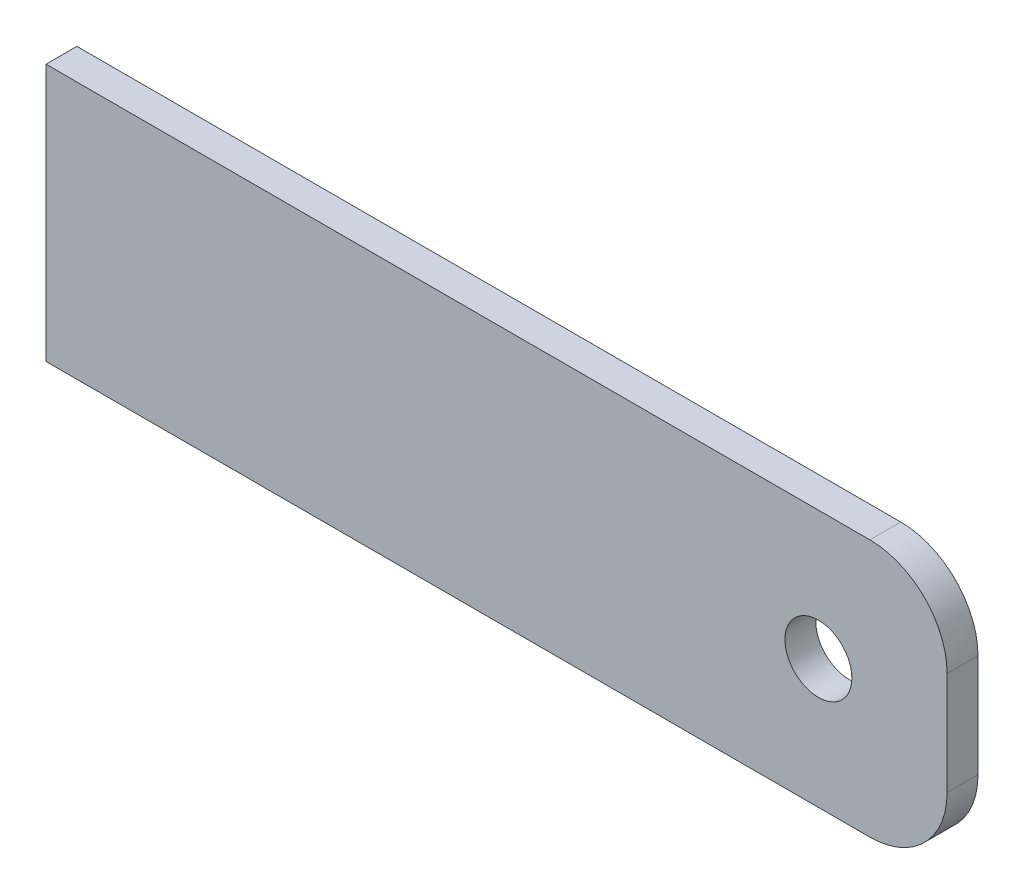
ISO-10303-21;
HEADER;
FILE_DESCRIPTION(('STEP AP214'),'2;1');
FILE_NAME('part.step','',(''),(''),'','','');
FILE_SCHEMA(('AUTOMOTIVE_DESIGN { 1 0 10303 214 1 1 1 1 }'));
ENDSEC;
DATA;
#1=APPLICATION_CONTEXT('core data for automotive mechanical design processes');
#2=APPLICATION_PROTOCOL_DEFINITION('international standard','automotive_design',2000,#1);
#3=PRODUCT_CONTEXT('',#1,'mechanical');
#4=PRODUCT('Part','Part','',(#3));
#5=PRODUCT_RELATED_PRODUCT_CATEGORY('part','',(#4));
#6=PRODUCT_DEFINITION_FORMATION('','',#4);
#7=PRODUCT_DEFINITION_CONTEXT('part definition',#1,'design');
#8=PRODUCT_DEFINITION('design','',#6,#7);
#9=PRODUCT_DEFINITION_SHAPE('','',#8);
#10=(LENGTH_UNIT() NAMED_UNIT(*) SI_UNIT(.MILLI.,.METRE.));
#11=(NAMED_UNIT(*) PLANE_ANGLE_UNIT() SI_UNIT($,.RADIAN.));
#12=(NAMED_UNIT(*) SI_UNIT($,.STERADIAN.) SOLID_ANGLE_UNIT());
#13=UNCERTAINTY_MEASURE_WITH_UNIT(LENGTH_MEASURE(1.E-05),#10,'distance_accuracy_value','');
#14=(GEOMETRIC_REPRESENTATION_CONTEXT(3) GLOBAL_UNCERTAINTY_ASSIGNED_CONTEXT((#13)) GLOBAL_UNIT_ASSIGNED_CONTEXT((#10,
#11,#12)) REPRESENTATION_CONTEXT('',''));
#15=CARTESIAN_POINT('',(0.,0.,0.));
#16=DIRECTION('',(0.,0.,1.));
#17=DIRECTION('',(1.,0.,0.));
#18=AXIS2_PLACEMENT_3D('',#15,#16,#17);
#19=CARTESIAN_POINT('',(320.,-70.,12.));
#20=DIRECTION('',(0.,0.,1.));
#21=DIRECTION('',(1.,0.,0.));
#22=AXIS2_PLACEMENT_3D('',#19,#20,#21);
#23=PLANE('',#22);
#24=DIRECTION('',(0.,-1.,0.));
#25=VECTOR('',#24,1.);
#26=CARTESIAN_POINT('',(0.,0.,12.));
#27=LINE('',#26,#25);
#28=CARTESIAN_POINT('',(0.,0.,12.));
#29=VERTEX_POINT('',#28);
#30=CARTESIAN_POINT('',(0.,-100.,12.));
#31=VERTEX_POINT('',#30);
#32=EDGE_CURVE('E115',#29,#31,#27,.T.);
#33=ORIENTED_EDGE('',*,*,#32,.T.);
#34=DIRECTION('',(1.,0.,0.));
#35=VECTOR('',#34,1.);
#36=CARTESIAN_POINT('',(0.,-100.,12.));
#37=LINE('',#36,#35);
#38=CARTESIAN_POINT('',(320.,-100.,12.));
#39=VERTEX_POINT('',#38);
#40=EDGE_CURVE('E96',#31,#39,#37,.T.);
#41=ORIENTED_EDGE('',*,*,#40,.T.);
#42=CARTESIAN_POINT('',(320.,-70.,12.));
#43=DIRECTION('',(0.,0.,1.));
#44=DIRECTION('',(1.,0.,0.));
#45=AXIS2_PLACEMENT_3D('',#42,#43,#44);
#46=CIRCLE('',#45,30.);
#47=CARTESIAN_POINT('',(350.,-70.,12.));
#48=VERTEX_POINT('',#47);
#49=EDGE_CURVE('E118',#39,#48,#46,.T.);
#50=ORIENTED_EDGE('',*,*,#49,.T.);
#51=DIRECTION('',(0.,1.,0.));
#52=VECTOR('',#51,1.);
#53=CARTESIAN_POINT('',(350.,-30.,12.));
#54=LINE('',#53,#52);
#55=CARTESIAN_POINT('',(350.,-30.,12.));
#56=VERTEX_POINT('',#55);
#57=EDGE_CURVE('E120',#48,#56,#54,.T.);
#58=ORIENTED_EDGE('',*,*,#57,.T.);
#59=CARTESIAN_POINT('',(320.,-30.,12.));
#60=DIRECTION('',(0.,0.,1.));
#61=DIRECTION('',(-1.,0.,0.));
#62=AXIS2_PLACEMENT_3D('',#59,#60,#61);
#63=CIRCLE('',#62,30.);
#64=CARTESIAN_POINT('',(320.,0.,12.));
#65=VERTEX_POINT('',#64);
#66=EDGE_CURVE('E49',#56,#65,#63,.T.);
#67=ORIENTED_EDGE('',*,*,#66,.T.);
#68=DIRECTION('',(-1.,0.,0.));
#69=VECTOR('',#68,1.);
#70=CARTESIAN_POINT('',(0.,0.,12.));
#71=LINE('',#70,#69);
#72=EDGE_CURVE('E44',#65,#29,#71,.T.);
#73=ORIENTED_EDGE('',*,*,#72,.T.);
#74=EDGE_LOOP('',(#33,#41,#50,#58,#67,#73));
#75=FACE_BOUND('',#74,.T.);
#76=CARTESIAN_POINT('',(300.,-50.,12.));
#77=DIRECTION('',(0.,0.,1.));
#78=DIRECTION('',(1.,0.,0.));
#79=AXIS2_PLACEMENT_3D('',#76,#77,#78);
#80=CIRCLE('',#79,13.);
#81=CARTESIAN_POINT('',(313.,-50.,12.));
#82=VERTEX_POINT('',#81);
#83=EDGE_CURVE('E101',#82,#82,#80,.T.);
#84=ORIENTED_EDGE('',*,*,#83,.F.);
#85=EDGE_LOOP('',(#84));
#86=FACE_BOUND('',#85,.T.);
#87=ADVANCED_FACE('F29',(#75,#86),#23,.T.);
#88=CARTESIAN_POINT('',(320.,-70.,0.));
#89=DIRECTION('',(0.,0.,1.));
#90=DIRECTION('',(1.,0.,0.));
#91=AXIS2_PLACEMENT_3D('',#88,#89,#90);
#92=PLANE('',#91);
#93=DIRECTION('',(0.,-1.,0.));
#94=VECTOR('',#93,1.);
#95=CARTESIAN_POINT('',(0.,0.,0.));
#96=LINE('',#95,#94);
#97=CARTESIAN_POINT('',(0.,0.,0.));
#98=VERTEX_POINT('',#97);
#99=CARTESIAN_POINT('',(0.,-100.,0.));
#100=VERTEX_POINT('',#99);
#101=EDGE_CURVE('E87',#98,#100,#96,.T.);
#102=ORIENTED_EDGE('',*,*,#101,.F.);
#103=DIRECTION('',(-1.,0.,0.));
#104=VECTOR('',#103,1.);
#105=CARTESIAN_POINT('',(0.,0.,0.));
#106=LINE('',#105,#104);
#107=CARTESIAN_POINT('',(320.,0.,0.));
#108=VERTEX_POINT('',#107);
#109=EDGE_CURVE('E113',#108,#98,#106,.T.);
#110=ORIENTED_EDGE('',*,*,#109,.F.);
#111=CARTESIAN_POINT('',(320.,-30.,0.));
#112=DIRECTION('',(0.,0.,1.));
#113=DIRECTION('',(-1.,0.,0.));
#114=AXIS2_PLACEMENT_3D('',#111,#112,#113);
#115=CIRCLE('',#114,30.);
#116=CARTESIAN_POINT('',(350.,-30.,0.));
#117=VERTEX_POINT('',#116);
#118=EDGE_CURVE('E111',#117,#108,#115,.T.);
#119=ORIENTED_EDGE('',*,*,#118,.F.);
#120=DIRECTION('',(0.,1.,0.));
#121=VECTOR('',#120,1.);
#122=CARTESIAN_POINT('',(350.,-30.,0.));
#123=LINE('',#122,#121);
#124=CARTESIAN_POINT('',(350.,-70.,0.));
#125=VERTEX_POINT('',#124);
#126=EDGE_CURVE('E109',#125,#117,#123,.T.);
#127=ORIENTED_EDGE('',*,*,#126,.F.);
#128=CARTESIAN_POINT('',(320.,-70.,0.));
#129=DIRECTION('',(0.,0.,1.));
#130=DIRECTION('',(1.,0.,0.));
#131=AXIS2_PLACEMENT_3D('',#128,#129,#130);
#132=CIRCLE('',#131,30.);
#133=CARTESIAN_POINT('',(320.,-100.,0.));
#134=VERTEX_POINT('',#133);
#135=EDGE_CURVE('E89',#134,#125,#132,.T.);
#136=ORIENTED_EDGE('',*,*,#135,.F.);
#137=DIRECTION('',(1.,0.,0.));
#138=VECTOR('',#137,1.);
#139=CARTESIAN_POINT('',(0.,-100.,0.));
#140=LINE('',#139,#138);
#141=EDGE_CURVE('E82',#100,#134,#140,.T.);
#142=ORIENTED_EDGE('',*,*,#141,.F.);
#143=EDGE_LOOP('',(#102,#110,#119,#127,#136,#142));
#144=FACE_BOUND('',#143,.T.);
#145=CARTESIAN_POINT('',(300.,-50.,0.));
#146=DIRECTION('',(0.,0.,1.));
#147=DIRECTION('',(1.,0.,0.));
#148=AXIS2_PLACEMENT_3D('',#145,#146,#147);
#149=CIRCLE('',#148,13.);
#150=CARTESIAN_POINT('',(313.,-50.,0.));
#151=VERTEX_POINT('',#150);
#152=EDGE_CURVE('E104',#151,#151,#149,.T.);
#153=ORIENTED_EDGE('',*,*,#152,.T.);
#154=EDGE_LOOP('',(#153));
#155=FACE_BOUND('',#154,.T.);
#156=ADVANCED_FACE('F83',(#144,#155),#92,.F.);
#157=CARTESIAN_POINT('',(0.,0.,12.));
#158=DIRECTION('',(1.,0.,0.));
#159=DIRECTION('',(0.,1.,0.));
#160=AXIS2_PLACEMENT_3D('',#157,#158,#159);
#161=PLANE('',#160);
#162=ORIENTED_EDGE('',*,*,#101,.T.);
#163=DIRECTION('',(0.,0.,-1.));
#164=VECTOR('',#163,1.);
#165=CARTESIAN_POINT('',(0.,-100.,12.));
#166=LINE('',#165,#164);
#167=EDGE_CURVE('E11',#31,#100,#166,.T.);
#168=ORIENTED_EDGE('',*,*,#167,.F.);
#169=ORIENTED_EDGE('',*,*,#32,.F.);
#170=DIRECTION('',(0.,0.,-1.));
#171=VECTOR('',#170,1.);
#172=CARTESIAN_POINT('',(0.,0.,12.));
#173=LINE('',#172,#171);
#174=EDGE_CURVE('E100',#29,#98,#173,.T.);
#175=ORIENTED_EDGE('',*,*,#174,.T.);
#176=EDGE_LOOP('',(#162,#168,#169,#175));
#177=FACE_BOUND('',#176,.T.);
#178=ADVANCED_FACE('F31',(#177),#161,.F.);
#179=CARTESIAN_POINT('',(0.,-100.,12.));
#180=DIRECTION('',(0.,1.,0.));
#181=DIRECTION('',(0.,0.,1.));
#182=AXIS2_PLACEMENT_3D('',#179,#180,#181);
#183=PLANE('',#182);
#184=ORIENTED_EDGE('',*,*,#141,.T.);
#185=DIRECTION('',(0.,0.,-1.));
#186=VECTOR('',#185,1.);
#187=CARTESIAN_POINT('',(320.,-100.,12.));
#188=LINE('',#187,#186);
#189=EDGE_CURVE('E37',#39,#134,#188,.T.);
#190=ORIENTED_EDGE('',*,*,#189,.F.);
#191=ORIENTED_EDGE('',*,*,#40,.F.);
#192=ORIENTED_EDGE('',*,*,#167,.T.);
#193=EDGE_LOOP('',(#184,#190,#191,#192));
#194=FACE_BOUND('',#193,.T.);
#195=ADVANCED_FACE('F95',(#194),#183,.F.);
#196=CARTESIAN_POINT('',(320.,-70.,12.));
#197=DIRECTION('',(0.,0.,-1.));
#198=DIRECTION('',(-1.,0.,0.));
#199=AXIS2_PLACEMENT_3D('',#196,#197,#198);
#200=CYLINDRICAL_SURFACE('',#199,30.);
#201=ORIENTED_EDGE('',*,*,#135,.T.);
#202=DIRECTION('',(0.,0.,-1.));
#203=VECTOR('',#202,1.);
#204=CARTESIAN_POINT('',(350.,-70.,12.));
#205=LINE('',#204,#203);
#206=EDGE_CURVE('E131',#48,#125,#205,.T.);
#207=ORIENTED_EDGE('',*,*,#206,.F.);
#208=ORIENTED_EDGE('',*,*,#49,.F.);
#209=ORIENTED_EDGE('',*,*,#189,.T.);
#210=EDGE_LOOP('',(#201,#207,#208,#209));
#211=FACE_BOUND('',#210,.T.);
#212=ADVANCED_FACE('F135',(#211),#200,.T.);
#213=CARTESIAN_POINT('',(350.,-30.,12.));
#214=DIRECTION('',(-1.,0.,0.));
#215=DIRECTION('',(0.,0.,1.));
#216=AXIS2_PLACEMENT_3D('',#213,#214,#215);
#217=PLANE('',#216);
#218=ORIENTED_EDGE('',*,*,#126,.T.);
#219=DIRECTION('',(0.,0.,-1.));
#220=VECTOR('',#219,1.);
#221=CARTESIAN_POINT('',(350.,-30.,12.));
#222=LINE('',#221,#220);
#223=EDGE_CURVE('E128',#56,#117,#222,.T.);
#224=ORIENTED_EDGE('',*,*,#223,.F.);
#225=ORIENTED_EDGE('',*,*,#57,.F.);
#226=ORIENTED_EDGE('',*,*,#206,.T.);
#227=EDGE_LOOP('',(#218,#224,#225,#226));
#228=FACE_BOUND('',#227,.T.);
#229=ADVANCED_FACE('F141',(#228),#217,.F.);
#230=CARTESIAN_POINT('',(320.,-30.,12.));
#231=DIRECTION('',(0.,0.,-1.));
#232=DIRECTION('',(-1.,0.,0.));
#233=AXIS2_PLACEMENT_3D('',#230,#231,#232);
#234=CYLINDRICAL_SURFACE('',#233,30.);
#235=ORIENTED_EDGE('',*,*,#118,.T.);
#236=DIRECTION('',(0.,0.,-1.));
#237=VECTOR('',#236,1.);
#238=CARTESIAN_POINT('',(320.,0.,12.));
#239=LINE('',#238,#237);
#240=EDGE_CURVE('E125',#65,#108,#239,.T.);
#241=ORIENTED_EDGE('',*,*,#240,.F.);
#242=ORIENTED_EDGE('',*,*,#66,.F.);
#243=ORIENTED_EDGE('',*,*,#223,.T.);
#244=EDGE_LOOP('',(#235,#241,#242,#243));
#245=FACE_BOUND('',#244,.T.);
#246=ADVANCED_FACE('F144',(#245),#234,.T.);
#247=CARTESIAN_POINT('',(0.,0.,12.));
#248=DIRECTION('',(0.,-1.,0.));
#249=DIRECTION('',(0.,0.,-1.));
#250=AXIS2_PLACEMENT_3D('',#247,#248,#249);
#251=PLANE('',#250);
#252=ORIENTED_EDGE('',*,*,#109,.T.);
#253=ORIENTED_EDGE('',*,*,#174,.F.);
#254=ORIENTED_EDGE('',*,*,#72,.F.);
#255=ORIENTED_EDGE('',*,*,#240,.T.);
#256=EDGE_LOOP('',(#252,#253,#254,#255));
#257=FACE_BOUND('',#256,.T.);
#258=ADVANCED_FACE('F146',(#257),#251,.F.);
#259=CARTESIAN_POINT('',(300.,-50.,12.));
#260=DIRECTION('',(0.,0.,-1.));
#261=DIRECTION('',(-1.,0.,0.));
#262=AXIS2_PLACEMENT_3D('',#259,#260,#261);
#263=CYLINDRICAL_SURFACE('',#262,13.);
#264=ORIENTED_EDGE('',*,*,#83,.T.);
#265=EDGE_LOOP('',(#264));
#266=FACE_BOUND('',#265,.T.);
#267=ORIENTED_EDGE('',*,*,#152,.F.);
#268=EDGE_LOOP('',(#267));
#269=FACE_BOUND('',#268,.T.);
#270=ADVANCED_FACE('F148',(#266,#269),#263,.F.);
#271=CLOSED_SHELL('',(#87,#156,#178,#195,#212,#229,#246,#258,#270));
#272=MANIFOLD_SOLID_BREP('B2',#271);
#273=ADVANCED_BREP_SHAPE_REPRESENTATION('',(#18,#272),#14);
#274=SHAPE_DEFINITION_REPRESENTATION(#9,#273);
ENDSEC;
END-ISO-10303-21;
